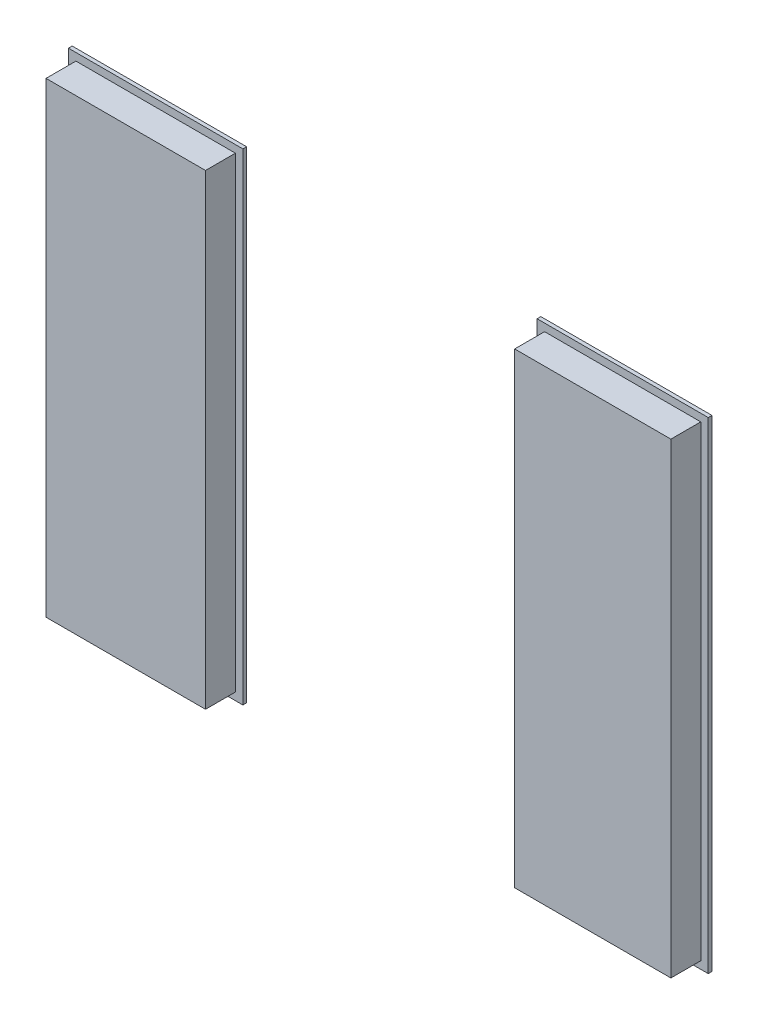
from build123d import *

# Parameters (mm, degrees)
SKETCH1_W             = 10.671985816
SKETCH1_H             = 31.228008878
BOSS_EXTRUDE1_DEPTH   = 2.25
SKETCH1_W_2           = 10.453073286
BOSS_EXTRUDE1_2_DEPTH = 2.25
SKETCH1_10_W          = 11.671985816
SKETCH1_10_H          = 32.228008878
SKETCH1_10_W_2        = 10.671985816
SKETCH1_10_H_2        = 31.228008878
SKETCH1_10_W_3        = 11.453073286
SKETCH1_10_W_4        = 10.453073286
BOSS_EXTRUDE2_DEPTH   = 0.25


with BuildPart() as part:
    # Sketch1 → Boss-Extrude1 (new body)
    with BuildSketch(Plane.XY):
        with Locations((47.342554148, 74.260044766)):
            Rectangle(SKETCH1_W, SKETCH1_H)
    extrude(amount=BOSS_EXTRUDE1_DEPTH)

    # Sketch1_10 → Boss-Extrude2 (add)
    # profile 1 of 2: a face of its own
    with BuildSketch(Plane.XY):
        with Locations((47.342554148, 74.260044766)):
            Rectangle(SKETCH1_10_W, SKETCH1_10_H)
        with Locations((47.342554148, 74.260044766)):
            Rectangle(SKETCH1_10_W_2, SKETCH1_10_H_2, mode=Mode.SUBTRACT)
    # profile 2 of 2: a face of its own
    with BuildSketch(Plane.XY):
        with Locations((78.592317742, 74.260044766)):
            Rectangle(SKETCH1_10_W_3, SKETCH1_10_H)
        with Locations((78.592317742, 74.260044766)):
            Rectangle(SKETCH1_10_W_4, SKETCH1_10_H_2, mode=Mode.SUBTRACT)
    extrude(amount=BOSS_EXTRUDE2_DEPTH)


with BuildPart() as body_2:
    # Sketch1 → Boss-Extrude1 2 (new body)
    with BuildSketch(Plane.XY):
        with Locations((78.592317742, 74.260044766)):
            Rectangle(SKETCH1_W_2, SKETCH1_H)
    extrude(amount=BOSS_EXTRUDE1_2_DEPTH)


with BuildPart() as boss_extrude2_piece_1:
    # of the separate pieces the step leaves, piece 1, a body of its own (boss_extrude2_pieces)
    add(part.part.solids().sort_by_distance((42.00656124, 58.646040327, 0.25))[0])


with BuildPart() as boss_extrude2_piece_2:
    # of the separate pieces the step leaves, piece 2, a body of its own (boss_extrude2_pieces)
    add(part.part.solids().sort_by_distance((84.318854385, 58.146040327, 0))[0])


solid = Compound([body_2.part, boss_extrude2_piece_1.part, boss_extrude2_piece_2.part])
